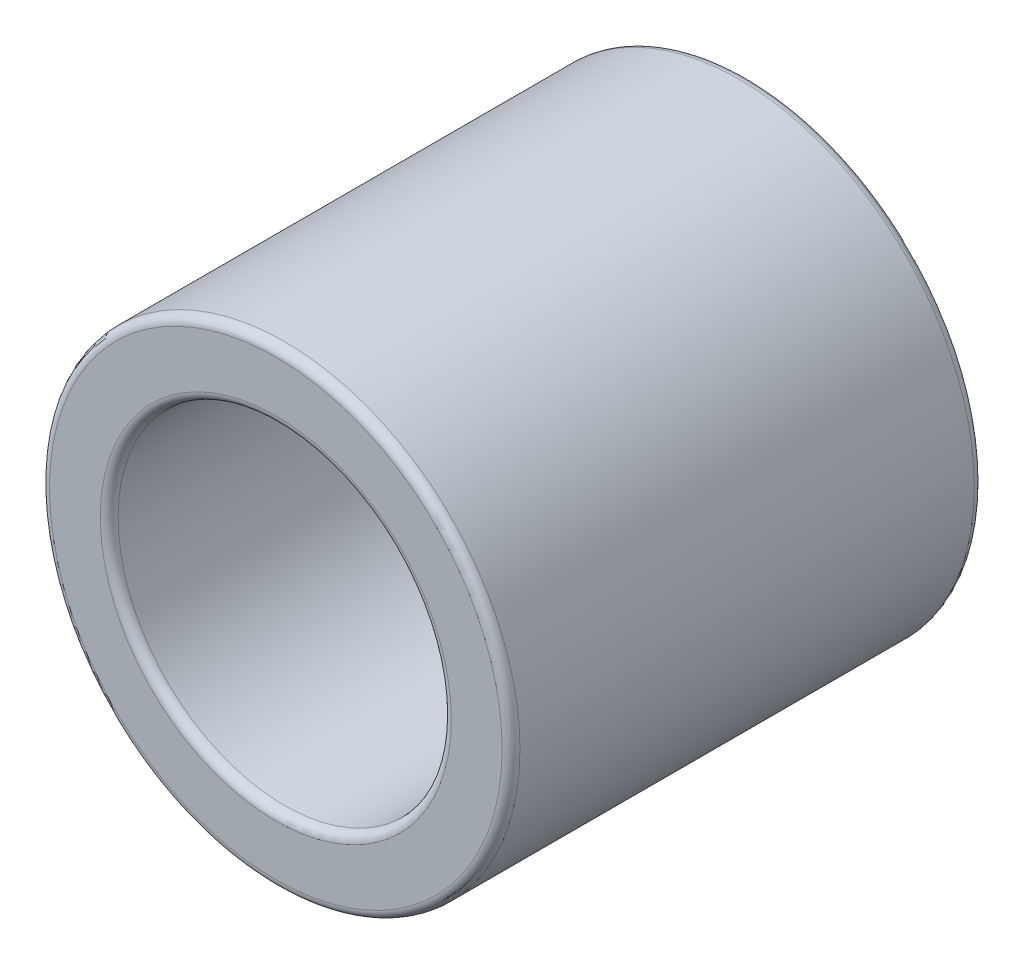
ISO-10303-21;
HEADER;
FILE_DESCRIPTION(('STEP AP214'),'2;1');
FILE_NAME('part.step','',(''),(''),'','','');
FILE_SCHEMA(('AUTOMOTIVE_DESIGN { 1 0 10303 214 1 1 1 1 }'));
ENDSEC;
DATA;
#1=APPLICATION_CONTEXT('core data for automotive mechanical design processes');
#2=APPLICATION_PROTOCOL_DEFINITION('international standard','automotive_design',2000,#1);
#3=PRODUCT_CONTEXT('',#1,'mechanical');
#4=PRODUCT('Part','Part','',(#3));
#5=PRODUCT_RELATED_PRODUCT_CATEGORY('part','',(#4));
#6=PRODUCT_DEFINITION_FORMATION('','',#4);
#7=PRODUCT_DEFINITION_CONTEXT('part definition',#1,'design');
#8=PRODUCT_DEFINITION('design','',#6,#7);
#9=PRODUCT_DEFINITION_SHAPE('','',#8);
#10=(LENGTH_UNIT() NAMED_UNIT(*) SI_UNIT(.MILLI.,.METRE.));
#11=(NAMED_UNIT(*) PLANE_ANGLE_UNIT() SI_UNIT($,.RADIAN.));
#12=(NAMED_UNIT(*) SI_UNIT($,.STERADIAN.) SOLID_ANGLE_UNIT());
#13=UNCERTAINTY_MEASURE_WITH_UNIT(LENGTH_MEASURE(1.E-05),#10,'distance_accuracy_value','');
#14=(GEOMETRIC_REPRESENTATION_CONTEXT(3) GLOBAL_UNCERTAINTY_ASSIGNED_CONTEXT((#13)) GLOBAL_UNIT_ASSIGNED_CONTEXT((#10,
#11,#12)) REPRESENTATION_CONTEXT('',''));
#15=CARTESIAN_POINT('',(0.,0.,0.));
#16=DIRECTION('',(0.,0.,1.));
#17=DIRECTION('',(1.,0.,0.));
#18=AXIS2_PLACEMENT_3D('',#15,#16,#17);
#19=CARTESIAN_POINT('',(0.,0.,3.3655));
#20=DIRECTION('',(0.,0.,1.));
#21=DIRECTION('',(1.,0.,0.));
#22=AXIS2_PLACEMENT_3D('',#19,#20,#21);
#23=PLANE('',#22);
#24=CARTESIAN_POINT('',(0.,0.,3.3655));
#25=DIRECTION('',(0.,0.,1.));
#26=DIRECTION('',(1.,0.,0.));
#27=AXIS2_PLACEMENT_3D('',#24,#25,#26);
#28=CIRCLE('',#27,3.2258);
#29=CARTESIAN_POINT('',(3.2258,0.,3.3655));
#30=VERTEX_POINT('',#29);
#31=EDGE_CURVE('E44',#30,#30,#28,.T.);
#32=ORIENTED_EDGE('',*,*,#31,.T.);
#33=EDGE_LOOP('',(#32));
#34=FACE_BOUND('',#33,.T.);
#35=CARTESIAN_POINT('',(0.,0.,3.3655));
#36=DIRECTION('',(0.,0.,1.));
#37=DIRECTION('',(1.,0.,0.));
#38=AXIS2_PLACEMENT_3D('',#35,#36,#37);
#39=CIRCLE('',#38,2.5019);
#40=CARTESIAN_POINT('',(2.5019,0.,3.3655));
#41=VERTEX_POINT('',#40);
#42=EDGE_CURVE('E48',#41,#41,#39,.F.);
#43=ORIENTED_EDGE('',*,*,#42,.T.);
#44=EDGE_LOOP('',(#43));
#45=FACE_BOUND('',#44,.T.);
#46=ADVANCED_FACE('F33',(#34,#45),#23,.T.);
#47=CARTESIAN_POINT('',(0.,0.,-3.3655));
#48=DIRECTION('',(0.,0.,1.));
#49=DIRECTION('',(1.,0.,0.));
#50=AXIS2_PLACEMENT_3D('',#47,#48,#49);
#51=PLANE('',#50);
#52=CARTESIAN_POINT('',(0.,0.,-3.3655));
#53=DIRECTION('',(0.,0.,1.));
#54=DIRECTION('',(1.,0.,0.));
#55=AXIS2_PLACEMENT_3D('',#52,#53,#54);
#56=CIRCLE('',#55,3.2258);
#57=CARTESIAN_POINT('',(3.2258,0.,-3.3655));
#58=VERTEX_POINT('',#57);
#59=EDGE_CURVE('E53',#58,#58,#56,.F.);
#60=ORIENTED_EDGE('',*,*,#59,.T.);
#61=EDGE_LOOP('',(#60));
#62=FACE_BOUND('',#61,.T.);
#63=CARTESIAN_POINT('',(0.,0.,-3.3655));
#64=DIRECTION('',(0.,0.,1.));
#65=DIRECTION('',(1.,0.,0.));
#66=AXIS2_PLACEMENT_3D('',#63,#64,#65);
#67=CIRCLE('',#66,2.5019);
#68=CARTESIAN_POINT('',(2.5019,0.,-3.3655));
#69=VERTEX_POINT('',#68);
#70=EDGE_CURVE('E56',#69,#69,#67,.T.);
#71=ORIENTED_EDGE('',*,*,#70,.T.);
#72=EDGE_LOOP('',(#71));
#73=FACE_BOUND('',#72,.T.);
#74=ADVANCED_FACE('F78',(#62,#73),#51,.F.);
#75=CARTESIAN_POINT('',(0.,0.,3.3655));
#76=DIRECTION('',(0.,0.,-1.));
#77=DIRECTION('',(-1.,0.,0.));
#78=AXIS2_PLACEMENT_3D('',#75,#76,#77);
#79=CYLINDRICAL_SURFACE('',#78,3.3528);
#80=CARTESIAN_POINT('',(0.,0.,-3.2385));
#81=DIRECTION('',(0.,0.,1.));
#82=DIRECTION('',(1.,0.,0.));
#83=AXIS2_PLACEMENT_3D('',#80,#81,#82);
#84=CIRCLE('',#83,3.3528);
#85=CARTESIAN_POINT('',(3.3528,0.,-3.2385));
#86=VERTEX_POINT('',#85);
#87=EDGE_CURVE('E59',#86,#86,#84,.T.);
#88=ORIENTED_EDGE('',*,*,#87,.T.);
#89=EDGE_LOOP('',(#88));
#90=FACE_BOUND('',#89,.T.);
#91=CARTESIAN_POINT('',(0.,0.,3.2385));
#92=DIRECTION('',(0.,0.,1.));
#93=DIRECTION('',(1.,0.,0.));
#94=AXIS2_PLACEMENT_3D('',#91,#92,#93);
#95=CIRCLE('',#94,3.3528);
#96=CARTESIAN_POINT('',(3.3528,0.,3.2385));
#97=VERTEX_POINT('',#96);
#98=EDGE_CURVE('E62',#97,#97,#95,.F.);
#99=ORIENTED_EDGE('',*,*,#98,.T.);
#100=EDGE_LOOP('',(#99));
#101=FACE_BOUND('',#100,.T.);
#102=ADVANCED_FACE('F66',(#90,#101),#79,.T.);
#103=CARTESIAN_POINT('',(0.,0.,3.3655));
#104=DIRECTION('',(0.,0.,-1.));
#105=DIRECTION('',(-1.,0.,0.));
#106=AXIS2_PLACEMENT_3D('',#103,#104,#105);
#107=CYLINDRICAL_SURFACE('',#106,2.3749);
#108=CARTESIAN_POINT('',(0.,0.,-3.2385));
#109=DIRECTION('',(0.,0.,1.));
#110=DIRECTION('',(1.,0.,0.));
#111=AXIS2_PLACEMENT_3D('',#108,#109,#110);
#112=CIRCLE('',#111,2.3749);
#113=CARTESIAN_POINT('',(2.3749,0.,-3.2385));
#114=VERTEX_POINT('',#113);
#115=EDGE_CURVE('E10',#114,#114,#112,.F.);
#116=ORIENTED_EDGE('',*,*,#115,.T.);
#117=EDGE_LOOP('',(#116));
#118=FACE_BOUND('',#117,.T.);
#119=CARTESIAN_POINT('',(0.,0.,3.2385));
#120=DIRECTION('',(0.,0.,1.));
#121=DIRECTION('',(1.,0.,0.));
#122=AXIS2_PLACEMENT_3D('',#119,#120,#121);
#123=CIRCLE('',#122,2.3749);
#124=CARTESIAN_POINT('',(2.3749,0.,3.2385));
#125=VERTEX_POINT('',#124);
#126=EDGE_CURVE('E40',#125,#125,#123,.T.);
#127=ORIENTED_EDGE('',*,*,#126,.T.);
#128=EDGE_LOOP('',(#127));
#129=FACE_BOUND('',#128,.T.);
#130=ADVANCED_FACE('F94',(#118,#129),#107,.F.);
#131=CARTESIAN_POINT('',(0.,0.,-3.2385));
#132=DIRECTION('',(0.,0.,1.));
#133=DIRECTION('',(1.,0.,0.));
#134=AXIS2_PLACEMENT_3D('',#131,#132,#133);
#135=TOROIDAL_SURFACE('',#134,3.2258,0.127);
#136=ORIENTED_EDGE('',*,*,#59,.F.);
#137=EDGE_LOOP('',(#136));
#138=FACE_BOUND('',#137,.T.);
#139=ORIENTED_EDGE('',*,*,#87,.F.);
#140=EDGE_LOOP('',(#139));
#141=FACE_BOUND('',#140,.T.);
#142=ADVANCED_FACE('F72',(#138,#141),#135,.T.);
#143=CARTESIAN_POINT('',(0.,0.,3.2385));
#144=DIRECTION('',(0.,0.,1.));
#145=DIRECTION('',(1.,0.,0.));
#146=AXIS2_PLACEMENT_3D('',#143,#144,#145);
#147=TOROIDAL_SURFACE('',#146,3.2258,0.127);
#148=ORIENTED_EDGE('',*,*,#98,.F.);
#149=EDGE_LOOP('',(#148));
#150=FACE_BOUND('',#149,.T.);
#151=ORIENTED_EDGE('',*,*,#31,.F.);
#152=EDGE_LOOP('',(#151));
#153=FACE_BOUND('',#152,.T.);
#154=ADVANCED_FACE('F68',(#150,#153),#147,.T.);
#155=CARTESIAN_POINT('',(0.,0.,-3.2385));
#156=DIRECTION('',(0.,0.,1.));
#157=DIRECTION('',(1.,0.,0.));
#158=AXIS2_PLACEMENT_3D('',#155,#156,#157);
#159=TOROIDAL_SURFACE('',#158,2.5019,0.127);
#160=ORIENTED_EDGE('',*,*,#115,.F.);
#161=EDGE_LOOP('',(#160));
#162=FACE_BOUND('',#161,.T.);
#163=ORIENTED_EDGE('',*,*,#70,.F.);
#164=EDGE_LOOP('',(#163));
#165=FACE_BOUND('',#164,.T.);
#166=ADVANCED_FACE('F71',(#162,#165),#159,.T.);
#167=CARTESIAN_POINT('',(0.,0.,3.2385));
#168=DIRECTION('',(0.,0.,1.));
#169=DIRECTION('',(1.,0.,0.));
#170=AXIS2_PLACEMENT_3D('',#167,#168,#169);
#171=TOROIDAL_SURFACE('',#170,2.5019,0.127);
#172=ORIENTED_EDGE('',*,*,#42,.F.);
#173=EDGE_LOOP('',(#172));
#174=FACE_BOUND('',#173,.T.);
#175=ORIENTED_EDGE('',*,*,#126,.F.);
#176=EDGE_LOOP('',(#175));
#177=FACE_BOUND('',#176,.T.);
#178=ADVANCED_FACE('F35',(#174,#177),#171,.T.);
#179=CLOSED_SHELL('',(#46,#74,#102,#130,#142,#154,#166,#178));
#180=MANIFOLD_SOLID_BREP('B2',#179);
#181=ADVANCED_BREP_SHAPE_REPRESENTATION('',(#18,#180),#14);
#182=SHAPE_DEFINITION_REPRESENTATION(#9,#181);
ENDSEC;
END-ISO-10303-21;
